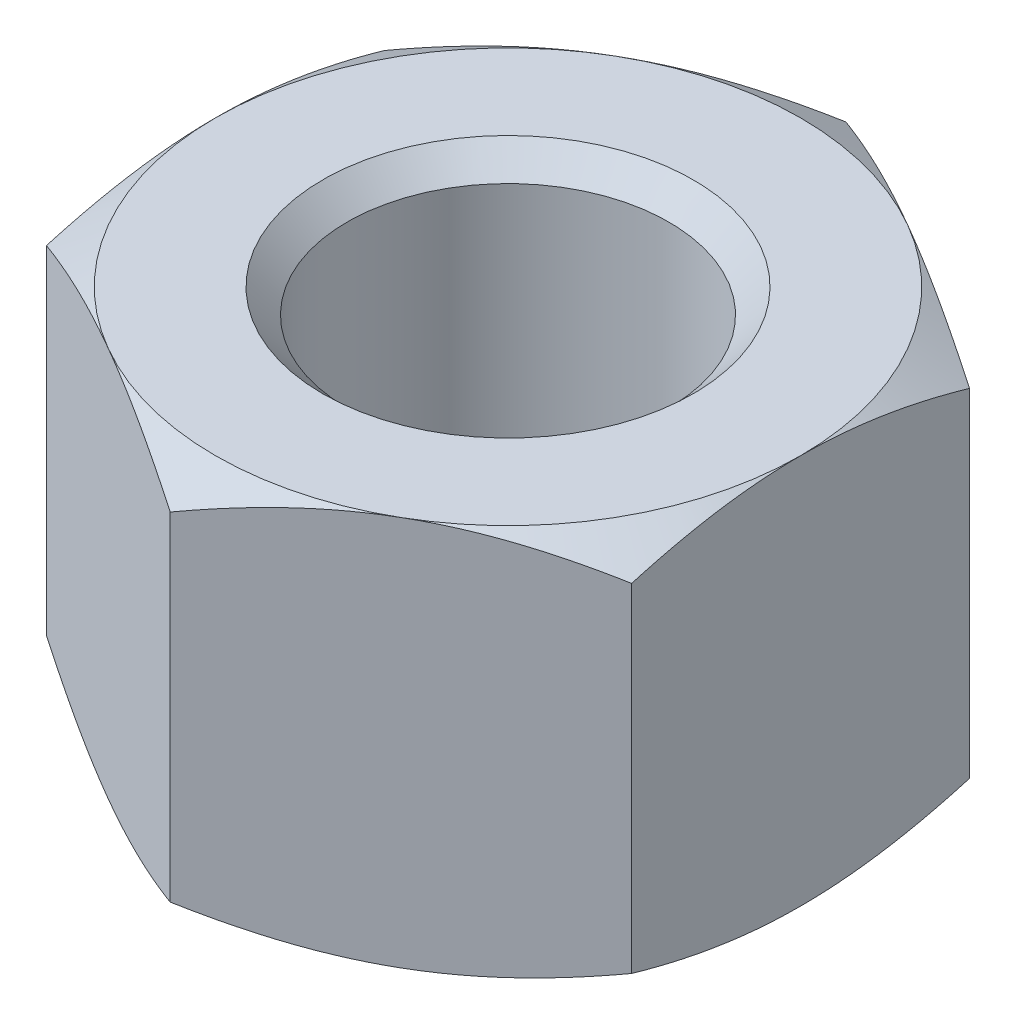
ISO-10303-21;
HEADER;
FILE_DESCRIPTION(('STEP AP214'),'2;1');
FILE_NAME('part.step','',(''),(''),'','','');
FILE_SCHEMA(('AUTOMOTIVE_DESIGN { 1 0 10303 214 1 1 1 1 }'));
ENDSEC;
DATA;
#1=APPLICATION_CONTEXT('core data for automotive mechanical design processes');
#2=APPLICATION_PROTOCOL_DEFINITION('international standard','automotive_design',2000,#1);
#3=PRODUCT_CONTEXT('',#1,'mechanical');
#4=PRODUCT('Part','Part','',(#3));
#5=PRODUCT_RELATED_PRODUCT_CATEGORY('part','',(#4));
#6=PRODUCT_DEFINITION_FORMATION('','',#4);
#7=PRODUCT_DEFINITION_CONTEXT('part definition',#1,'design');
#8=PRODUCT_DEFINITION('design','',#6,#7);
#9=PRODUCT_DEFINITION_SHAPE('','',#8);
#10=(LENGTH_UNIT() NAMED_UNIT(*) SI_UNIT(.MILLI.,.METRE.));
#11=(NAMED_UNIT(*) PLANE_ANGLE_UNIT() SI_UNIT($,.RADIAN.));
#12=(NAMED_UNIT(*) SI_UNIT($,.STERADIAN.) SOLID_ANGLE_UNIT());
#13=UNCERTAINTY_MEASURE_WITH_UNIT(LENGTH_MEASURE(1.E-05),#10,'distance_accuracy_value','');
#14=(GEOMETRIC_REPRESENTATION_CONTEXT(3) GLOBAL_UNCERTAINTY_ASSIGNED_CONTEXT((#13)) GLOBAL_UNIT_ASSIGNED_CONTEXT((#10,
#11,#12)) REPRESENTATION_CONTEXT('',''));
#15=CARTESIAN_POINT('',(0.,0.,0.));
#16=DIRECTION('',(0.,0.,1.));
#17=DIRECTION('',(1.,0.,0.));
#18=AXIS2_PLACEMENT_3D('',#15,#16,#17);
#19=CARTESIAN_POINT('',(0.,-2.,0.));
#20=DIRECTION('',(0.,1.,0.));
#21=DIRECTION('',(0.,0.,1.));
#22=AXIS2_PLACEMENT_3D('',#19,#20,#21);
#23=PLANE('',#22);
#24=CARTESIAN_POINT('',(0.,-2.,0.));
#25=DIRECTION('',(0.,1.,0.));
#26=DIRECTION('',(0.,0.,1.));
#27=AXIS2_PLACEMENT_3D('',#24,#25,#26);
#28=CIRCLE('',#27,1.9);
#29=CARTESIAN_POINT('',(0.,-2.,1.9));
#30=VERTEX_POINT('',#29);
#31=EDGE_CURVE('E12',#30,#30,#28,.T.);
#32=ORIENTED_EDGE('',*,*,#31,.T.);
#33=EDGE_LOOP('',(#32));
#34=FACE_BOUND('',#33,.T.);
#35=CARTESIAN_POINT('',(0.,-2.,0.));
#36=DIRECTION('',(0.,1.,0.));
#37=DIRECTION('',(0.,0.,1.));
#38=AXIS2_PLACEMENT_3D('',#35,#36,#37);
#39=CIRCLE('',#38,3.);
#40=CARTESIAN_POINT('',(1.5,-2.,2.59807621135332));
#41=VERTEX_POINT('',#40);
#42=CARTESIAN_POINT('',(-1.5,-2.,2.59807621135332));
#43=VERTEX_POINT('',#42);
#44=EDGE_CURVE('E140',#41,#43,#39,.F.);
#45=ORIENTED_EDGE('',*,*,#44,.T.);
#46=CARTESIAN_POINT('',(-3.,-2.,0.));
#47=VERTEX_POINT('',#46);
#48=EDGE_CURVE('E53',#43,#47,#39,.F.);
#49=ORIENTED_EDGE('',*,*,#48,.T.);
#50=CARTESIAN_POINT('',(-1.5,-2.,-2.59807621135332));
#51=VERTEX_POINT('',#50);
#52=EDGE_CURVE('E379',#47,#51,#39,.F.);
#53=ORIENTED_EDGE('',*,*,#52,.T.);
#54=CARTESIAN_POINT('',(1.5,-2.,-2.59807621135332));
#55=VERTEX_POINT('',#54);
#56=EDGE_CURVE('E381',#51,#55,#39,.F.);
#57=ORIENTED_EDGE('',*,*,#56,.T.);
#58=CARTESIAN_POINT('',(3.,-2.,0.));
#59=VERTEX_POINT('',#58);
#60=EDGE_CURVE('E145',#55,#59,#39,.F.);
#61=ORIENTED_EDGE('',*,*,#60,.T.);
#62=CARTESIAN_POINT('',(0.,-2.,0.));
#63=DIRECTION('',(0.,1.,0.));
#64=DIRECTION('',(0.,0.,1.));
#65=AXIS2_PLACEMENT_3D('',#62,#63,#64);
#66=CIRCLE('',#65,3.);
#67=EDGE_CURVE('E131',#41,#59,#66,.T.);
#68=ORIENTED_EDGE('',*,*,#67,.F.);
#69=EDGE_LOOP('',(#45,#49,#53,#57,#61,#68));
#70=FACE_BOUND('',#69,.T.);
#71=ADVANCED_FACE('F38',(#34,#70),#23,.F.);
#72=CARTESIAN_POINT('',(0.,2.,3.46410161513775));
#73=DIRECTION('',(-0.5,0.,-0.866025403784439));
#74=DIRECTION('',(-0.866025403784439,0.,0.5));
#75=AXIS2_PLACEMENT_3D('',#72,#73,#74);
#76=PLANE('',#75);
#77=DIRECTION('',(0.,-1.,0.));
#78=VECTOR('',#77,1.);
#79=CARTESIAN_POINT('',(0.,2.,3.46410161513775));
#80=LINE('',#79,#78);
#81=CARTESIAN_POINT('',(0.,1.73205080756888,3.46410161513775));
#82=VERTEX_POINT('',#81);
#83=CARTESIAN_POINT('',(0.,-1.73205080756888,3.46410161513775));
#84=VERTEX_POINT('',#83);
#85=EDGE_CURVE('E155',#82,#84,#80,.T.);
#86=ORIENTED_EDGE('',*,*,#85,.T.);
#87=CARTESIAN_POINT('',(-0.000200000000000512,-1.73198413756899,3.46421708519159));
#88=CARTESIAN_POINT('',(0.131635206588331,-1.77594629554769,3.38810199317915));
#89=CARTESIAN_POINT('',(0.264608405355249,-1.81592841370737,3.31132988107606));
#90=CARTESIAN_POINT('',(0.532857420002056,-1.88571791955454,3.15645624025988));
#91=CARTESIAN_POINT('',(0.668138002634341,-1.91550061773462,3.078351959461));
#92=CARTESIAN_POINT('',(0.937022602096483,-1.96186216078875,2.92311136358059));
#93=CARTESIAN_POINT('',(1.07058524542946,-1.97874955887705,2.84599893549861));
#94=CARTESIAN_POINT('',(1.33833905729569,-1.99891035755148,2.6914112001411));
#95=CARTESIAN_POINT('',(1.47252925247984,-2.00220045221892,2.61393645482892));
#96=CARTESIAN_POINT('',(1.72327559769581,-1.99535946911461,2.46916798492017));
#97=CARTESIAN_POINT('',(1.83986926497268,-1.98690808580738,2.40185259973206));
#98=CARTESIAN_POINT('',(2.07229698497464,-1.96012105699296,2.2676603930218));
#99=CARTESIAN_POINT('',(2.18813023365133,-1.94177625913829,2.2007840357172));
#100=CARTESIAN_POINT('',(2.42103725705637,-1.89591524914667,2.06631510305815));
#101=CARTESIAN_POINT('',(2.53808155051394,-1.86820461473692,1.99873954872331));
#102=CARTESIAN_POINT('',(2.77042435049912,-1.8053122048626,1.86459637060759));
#103=CARTESIAN_POINT('',(2.88572583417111,-1.77014520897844,1.79802702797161));
#104=CARTESIAN_POINT('',(3.0002,-1.73198413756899,1.73193533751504));
#105=B_SPLINE_CURVE_WITH_KNOTS('',3,(#87,#88,#89,#90,#91,#92,#93,#94,#95,#96,#97,#98,#99,#100,
#101,#102,#103,#104),.UNSPECIFIED.,.F.,.F.,(4,2,2,2,2,2,2,2,4),(0.,0.475539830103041,
0.952222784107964,1.41710776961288,1.88142182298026,2.28572436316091,2.69040156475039,
3.10405572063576,3.5168974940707),.UNSPECIFIED.);
#106=EDGE_CURVE('E60',#84,#41,#105,.T.);
#107=ORIENTED_EDGE('',*,*,#106,.T.);
#108=CARTESIAN_POINT('',(3.,-1.73205080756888,1.73205080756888));
#109=VERTEX_POINT('',#108);
#110=EDGE_CURVE('E128',#41,#109,#105,.T.);
#111=ORIENTED_EDGE('',*,*,#110,.T.);
#112=DIRECTION('',(0.,-1.,0.));
#113=VECTOR('',#112,1.);
#114=CARTESIAN_POINT('',(3.,2.,1.73205080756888));
#115=LINE('',#114,#113);
#116=CARTESIAN_POINT('',(3.,1.73205080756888,1.73205080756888));
#117=VERTEX_POINT('',#116);
#118=EDGE_CURVE('E272',#117,#109,#115,.T.);
#119=ORIENTED_EDGE('',*,*,#118,.F.);
#120=CARTESIAN_POINT('',(-0.000200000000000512,1.73198413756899,3.46421708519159));
#121=CARTESIAN_POINT('',(0.131635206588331,1.77594629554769,3.38810199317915));
#122=CARTESIAN_POINT('',(0.264608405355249,1.81592841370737,3.31132988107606));
#123=CARTESIAN_POINT('',(0.532857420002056,1.88571791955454,3.15645624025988));
#124=CARTESIAN_POINT('',(0.668138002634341,1.91550061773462,3.078351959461));
#125=CARTESIAN_POINT('',(0.937022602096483,1.96186216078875,2.92311136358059));
#126=CARTESIAN_POINT('',(1.07058524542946,1.97874955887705,2.84599893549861));
#127=CARTESIAN_POINT('',(1.33833905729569,1.99891035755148,2.6914112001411));
#128=CARTESIAN_POINT('',(1.47252925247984,2.00220045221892,2.61393645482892));
#129=CARTESIAN_POINT('',(1.72327559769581,1.99535946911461,2.46916798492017));
#130=CARTESIAN_POINT('',(1.83986926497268,1.98690808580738,2.40185259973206));
#131=CARTESIAN_POINT('',(2.07229698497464,1.96012105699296,2.2676603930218));
#132=CARTESIAN_POINT('',(2.18813023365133,1.94177625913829,2.2007840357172));
#133=CARTESIAN_POINT('',(2.42103725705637,1.89591524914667,2.06631510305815));
#134=CARTESIAN_POINT('',(2.53808155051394,1.86820461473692,1.99873954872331));
#135=CARTESIAN_POINT('',(2.77042435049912,1.8053122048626,1.86459637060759));
#136=CARTESIAN_POINT('',(2.88572583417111,1.77014520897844,1.79802702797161));
#137=CARTESIAN_POINT('',(3.0002,1.73198413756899,1.73193533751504));
#138=B_SPLINE_CURVE_WITH_KNOTS('',3,(#120,#121,#122,#123,#124,#125,#126,#127,#128,#129,#130,
#131,#132,#133,#134,#135,#136,#137),.UNSPECIFIED.,.F.,.F.,(4,2,2,2,2,2,2,2,4),(0.,
0.475539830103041,0.952222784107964,1.41710776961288,1.88142182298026,2.28572436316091,
2.69040156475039,3.10405572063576,3.5168974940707),.UNSPECIFIED.);
#139=CARTESIAN_POINT('',(1.5,2.,2.59807621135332));
#140=VERTEX_POINT('',#139);
#141=EDGE_CURVE('E252',#140,#117,#138,.T.);
#142=ORIENTED_EDGE('',*,*,#141,.F.);
#143=EDGE_CURVE('E258',#82,#140,#138,.T.);
#144=ORIENTED_EDGE('',*,*,#143,.F.);
#145=EDGE_LOOP('',(#86,#107,#111,#119,#142,#144));
#146=FACE_BOUND('',#145,.T.);
#147=ADVANCED_FACE('F152',(#146),#76,.F.);
#148=CARTESIAN_POINT('',(3.,2.,1.73205080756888));
#149=DIRECTION('',(-1.,0.,0.));
#150=DIRECTION('',(0.,0.,1.));
#151=AXIS2_PLACEMENT_3D('',#148,#149,#150);
#152=PLANE('',#151);
#153=ORIENTED_EDGE('',*,*,#118,.T.);
#154=CARTESIAN_POINT('',(3.,-0.501054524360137,-4.72419421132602));
#155=CARTESIAN_POINT('',(3.,-0.565208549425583,-4.59252982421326));
#156=CARTESIAN_POINT('',(3.,-0.628767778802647,-4.46057075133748));
#157=CARTESIAN_POINT('',(3.,-0.75436344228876,-4.19590675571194));
#158=CARTESIAN_POINT('',(3.,-0.816399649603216,-4.06320172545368));
#159=CARTESIAN_POINT('',(3.,-0.938912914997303,-3.79623955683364));
#160=CARTESIAN_POINT('',(3.,-0.999380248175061,-3.66197794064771));
#161=CARTESIAN_POINT('',(3.,-1.11793387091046,-3.39241144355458));
#162=CARTESIAN_POINT('',(3.,-1.17602026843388,-3.25710661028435));
#163=CARTESIAN_POINT('',(3.,-1.29110063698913,-2.98063811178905));
#164=CARTESIAN_POINT('',(3.,-1.34799110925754,-2.83943113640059));
#165=CARTESIAN_POINT('',(3.,-1.45763737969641,-2.55539190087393));
#166=CARTESIAN_POINT('',(3.,-1.51039272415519,-2.41255946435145));
#167=CARTESIAN_POINT('',(3.,-1.61043634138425,-2.12528687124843));
#168=CARTESIAN_POINT('',(3.,-1.65773508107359,-1.98085039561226));
#169=CARTESIAN_POINT('',(3.,-1.74539546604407,-1.68990675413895));
#170=CARTESIAN_POINT('',(3.,-1.78575922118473,-1.54340023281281));
#171=CARTESIAN_POINT('',(3.,-1.8574462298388,-1.2490437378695));
#172=CARTESIAN_POINT('',(3.,-1.88882005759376,-1.10120630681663));
#173=CARTESIAN_POINT('',(3.,-1.94080019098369,-0.803620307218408));
#174=CARTESIAN_POINT('',(3.,-1.96140766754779,-0.653871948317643));
#175=CARTESIAN_POINT('',(3.,-1.98994502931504,-0.355196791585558));
#176=CARTESIAN_POINT('',(3.,-1.99804348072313,-0.206286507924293));
#177=CARTESIAN_POINT('',(3.,-2.0013247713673,0.0916923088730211));
#178=CARTESIAN_POINT('',(3.,-1.9965074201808,0.240760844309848));
#179=CARTESIAN_POINT('',(3.,-1.97787199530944,0.491723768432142));
#180=CARTESIAN_POINT('',(3.,-1.96731758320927,0.593876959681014));
#181=CARTESIAN_POINT('',(3.,-1.94076249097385,0.797477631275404));
#182=CARTESIAN_POINT('',(3.,-1.92476113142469,0.898925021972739));
#183=CARTESIAN_POINT('',(3.,-1.86942337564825,1.20204703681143));
#184=CARTESIAN_POINT('',(3.,-1.82276174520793,1.40240158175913));
#185=CARTESIAN_POINT('',(3.,-1.74129864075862,1.70214891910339));
#186=CARTESIAN_POINT('',(3.,-1.71182816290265,1.80307937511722));
#187=CARTESIAN_POINT('',(3.,-1.64969066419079,2.00396102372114));
#188=CARTESIAN_POINT('',(3.,-1.61702361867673,2.10391220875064));
#189=CARTESIAN_POINT('',(3.,-1.54902842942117,2.30286555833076));
#190=CARTESIAN_POINT('',(3.,-1.51370103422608,2.40186798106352));
#191=CARTESIAN_POINT('',(3.,-1.44081429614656,2.59904247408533));
#192=CARTESIAN_POINT('',(3.,-1.40325500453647,2.69721456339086));
#193=CARTESIAN_POINT('',(3.,-1.29921162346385,2.96159002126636));
#194=CARTESIAN_POINT('',(3.,-1.23095748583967,3.12709614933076));
#195=CARTESIAN_POINT('',(3.,-1.09043300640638,3.45640087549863));
#196=CARTESIAN_POINT('',(3.,-1.01816221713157,3.62019928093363));
#197=CARTESIAN_POINT('',(3.,-0.870559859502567,3.94647574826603));
#198=CARTESIAN_POINT('',(3.,-0.795227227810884,4.10895332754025));
#199=CARTESIAN_POINT('',(3.,-0.642221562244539,4.43280485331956));
#200=CARTESIAN_POINT('',(3.,-0.564548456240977,4.59417876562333));
#201=CARTESIAN_POINT('',(3.,-0.328572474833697,5.07748126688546));
#202=CARTESIAN_POINT('',(3.,-0.167548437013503,5.39807947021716));
#203=CARTESIAN_POINT('',(3.,0.159040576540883,6.03685099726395));
#204=CARTESIAN_POINT('',(3.,0.324604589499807,6.35502481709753));
#205=CARTESIAN_POINT('',(3.,0.641121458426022,6.95610524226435));
#206=CARTESIAN_POINT('',(3.,0.791763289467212,7.23917590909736));
#207=CARTESIAN_POINT('',(3.,1.09485975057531,7.80436605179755));
#208=CARTESIAN_POINT('',(3.,1.24731449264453,8.08648546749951));
#209=CARTESIAN_POINT('',(3.,1.55305256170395,8.6490441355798));
#210=CARTESIAN_POINT('',(3.,1.70633136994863,8.92948584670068));
#211=CARTESIAN_POINT('',(3.,2.01391884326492,9.4897751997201));
#212=CARTESIAN_POINT('',(3.,2.16822742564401,9.76962288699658));
#213=CARTESIAN_POINT('',(3.,2.32291043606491,10.0492620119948));
#214=B_SPLINE_CURVE_WITH_KNOTS('',3,(#154,#155,#156,#157,#158,#159,#160,#161,#162,#163,#164,
#165,#166,#167,#168,#169,#170,#171,#172,#173,#174,#175,#176,#177,#178,#179,#180,#181,#182,#183,
#184,#185,#186,#187,#188,#189,#190,#191,#192,#193,#194,#195,#196,#197,#198,#199,#200,#201,#202,
#203,#204,#205,#206,#207,#208,#209,#210,#211,#212,#213),.UNSPECIFIED.,.F.,.F.,(4,2,2,2,2,2,2,2,
2,2,2,2,2,2,2,2,2,2,2,2,2,2,2,2,2,2,2,2,2,4),(0.,0.439392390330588,0.878849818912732,
1.32058042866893,1.76229098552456,2.21895022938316,2.67565950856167,3.13147762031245,
3.58715681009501,4.04021978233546,4.49323346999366,4.94008757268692,5.38694826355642,
5.69489123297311,6.00287262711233,6.61913487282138,6.934541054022,7.24994966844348,
7.56526986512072,7.88058282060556,8.41758645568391,8.95465003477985,9.49190174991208,
10.0291700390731,11.1053945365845,12.1813925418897,13.1433594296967,14.1053860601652,
15.0641732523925,16.0228843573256),.UNSPECIFIED.);
#215=EDGE_CURVE('E134',#109,#59,#214,.F.);
#216=ORIENTED_EDGE('',*,*,#215,.T.);
#217=CARTESIAN_POINT('',(3.,-1.73205080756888,-1.73205080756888));
#218=VERTEX_POINT('',#217);
#219=EDGE_CURVE('E167',#59,#218,#214,.F.);
#220=ORIENTED_EDGE('',*,*,#219,.T.);
#221=DIRECTION('',(0.,-1.,0.));
#222=VECTOR('',#221,1.);
#223=CARTESIAN_POINT('',(3.,2.,-1.73205080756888));
#224=LINE('',#223,#222);
#225=CARTESIAN_POINT('',(3.,1.73205080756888,-1.73205080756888));
#226=VERTEX_POINT('',#225);
#227=EDGE_CURVE('E269',#226,#218,#224,.T.);
#228=ORIENTED_EDGE('',*,*,#227,.F.);
#229=CARTESIAN_POINT('',(3.,0.501054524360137,-4.72419421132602));
#230=CARTESIAN_POINT('',(3.,0.565208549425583,-4.59252982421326));
#231=CARTESIAN_POINT('',(3.,0.628767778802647,-4.46057075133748));
#232=CARTESIAN_POINT('',(3.,0.75436344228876,-4.19590675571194));
#233=CARTESIAN_POINT('',(3.,0.816399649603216,-4.06320172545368));
#234=CARTESIAN_POINT('',(3.,0.938912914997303,-3.79623955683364));
#235=CARTESIAN_POINT('',(3.,0.999380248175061,-3.66197794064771));
#236=CARTESIAN_POINT('',(3.,1.11793387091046,-3.39241144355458));
#237=CARTESIAN_POINT('',(3.,1.17602026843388,-3.25710661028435));
#238=CARTESIAN_POINT('',(3.,1.29110063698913,-2.98063811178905));
#239=CARTESIAN_POINT('',(3.,1.34799110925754,-2.83943113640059));
#240=CARTESIAN_POINT('',(3.,1.45763737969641,-2.55539190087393));
#241=CARTESIAN_POINT('',(3.,1.51039272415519,-2.41255946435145));
#242=CARTESIAN_POINT('',(3.,1.61043634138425,-2.12528687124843));
#243=CARTESIAN_POINT('',(3.,1.65773508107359,-1.98085039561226));
#244=CARTESIAN_POINT('',(3.,1.74539546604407,-1.68990675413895));
#245=CARTESIAN_POINT('',(3.,1.78575922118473,-1.54340023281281));
#246=CARTESIAN_POINT('',(3.,1.8574462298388,-1.2490437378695));
#247=CARTESIAN_POINT('',(3.,1.88882005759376,-1.10120630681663));
#248=CARTESIAN_POINT('',(3.,1.94080019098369,-0.803620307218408));
#249=CARTESIAN_POINT('',(3.,1.96140766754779,-0.653871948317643));
#250=CARTESIAN_POINT('',(3.,1.98994502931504,-0.355196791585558));
#251=CARTESIAN_POINT('',(3.,1.99804348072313,-0.206286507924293));
#252=CARTESIAN_POINT('',(3.,2.0013247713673,0.0916923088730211));
#253=CARTESIAN_POINT('',(3.,1.9965074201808,0.240760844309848));
#254=CARTESIAN_POINT('',(3.,1.97787199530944,0.491723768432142));
#255=CARTESIAN_POINT('',(3.,1.96731758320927,0.593876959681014));
#256=CARTESIAN_POINT('',(3.,1.94076249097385,0.797477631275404));
#257=CARTESIAN_POINT('',(3.,1.92476113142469,0.898925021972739));
#258=CARTESIAN_POINT('',(3.,1.86942337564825,1.20204703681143));
#259=CARTESIAN_POINT('',(3.,1.82276174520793,1.40240158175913));
#260=CARTESIAN_POINT('',(3.,1.74129864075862,1.70214891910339));
#261=CARTESIAN_POINT('',(3.,1.71182816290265,1.80307937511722));
#262=CARTESIAN_POINT('',(3.,1.64969066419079,2.00396102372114));
#263=CARTESIAN_POINT('',(3.,1.61702361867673,2.10391220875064));
#264=CARTESIAN_POINT('',(3.,1.54902842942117,2.30286555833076));
#265=CARTESIAN_POINT('',(3.,1.51370103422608,2.40186798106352));
#266=CARTESIAN_POINT('',(3.,1.44081429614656,2.59904247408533));
#267=CARTESIAN_POINT('',(3.,1.40325500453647,2.69721456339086));
#268=CARTESIAN_POINT('',(3.,1.29921162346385,2.96159002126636));
#269=CARTESIAN_POINT('',(3.,1.23095748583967,3.12709614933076));
#270=CARTESIAN_POINT('',(3.,1.09043300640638,3.45640087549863));
#271=CARTESIAN_POINT('',(3.,1.01816221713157,3.62019928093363));
#272=CARTESIAN_POINT('',(3.,0.870559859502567,3.94647574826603));
#273=CARTESIAN_POINT('',(3.,0.795227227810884,4.10895332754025));
#274=CARTESIAN_POINT('',(3.,0.642221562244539,4.43280485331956));
#275=CARTESIAN_POINT('',(3.,0.564548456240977,4.59417876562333));
#276=CARTESIAN_POINT('',(3.,0.328572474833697,5.07748126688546));
#277=CARTESIAN_POINT('',(3.,0.167548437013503,5.39807947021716));
#278=CARTESIAN_POINT('',(3.,-0.159040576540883,6.03685099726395));
#279=CARTESIAN_POINT('',(3.,-0.324604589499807,6.35502481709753));
#280=CARTESIAN_POINT('',(3.,-0.641121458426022,6.95610524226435));
#281=CARTESIAN_POINT('',(3.,-0.791763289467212,7.23917590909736));
#282=CARTESIAN_POINT('',(3.,-1.09485975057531,7.80436605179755));
#283=CARTESIAN_POINT('',(3.,-1.24731449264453,8.08648546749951));
#284=CARTESIAN_POINT('',(3.,-1.55305256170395,8.6490441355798));
#285=CARTESIAN_POINT('',(3.,-1.70633136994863,8.92948584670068));
#286=CARTESIAN_POINT('',(3.,-2.01391884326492,9.4897751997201));
#287=CARTESIAN_POINT('',(3.,-2.16822742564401,9.76962288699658));
#288=CARTESIAN_POINT('',(3.,-2.32291043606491,10.0492620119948));
#289=B_SPLINE_CURVE_WITH_KNOTS('',3,(#229,#230,#231,#232,#233,#234,#235,#236,#237,#238,#239,
#240,#241,#242,#243,#244,#245,#246,#247,#248,#249,#250,#251,#252,#253,#254,#255,#256,#257,#258,
#259,#260,#261,#262,#263,#264,#265,#266,#267,#268,#269,#270,#271,#272,#273,#274,#275,#276,#277,
#278,#279,#280,#281,#282,#283,#284,#285,#286,#287,#288),.UNSPECIFIED.,.F.,.F.,(4,2,2,2,2,2,2,2,
2,2,2,2,2,2,2,2,2,2,2,2,2,2,2,2,2,2,2,2,2,4),(0.,0.439392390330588,0.878849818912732,
1.32058042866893,1.76229098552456,2.21895022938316,2.67565950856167,3.13147762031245,
3.58715681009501,4.04021978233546,4.49323346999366,4.94008757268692,5.38694826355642,
5.69489123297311,6.00287262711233,6.61913487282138,6.934541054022,7.24994966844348,
7.56526986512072,7.88058282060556,8.41758645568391,8.95465003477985,9.49190174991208,
10.0291700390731,11.1053945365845,12.1813925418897,13.1433594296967,14.1053860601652,
15.0641732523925,16.0228843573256),.UNSPECIFIED.);
#290=CARTESIAN_POINT('',(3.,2.,0.));
#291=VERTEX_POINT('',#290);
#292=EDGE_CURVE('E245',#291,#226,#289,.F.);
#293=ORIENTED_EDGE('',*,*,#292,.F.);
#294=EDGE_CURVE('E251',#117,#291,#289,.F.);
#295=ORIENTED_EDGE('',*,*,#294,.F.);
#296=EDGE_LOOP('',(#153,#216,#220,#228,#293,#295));
#297=FACE_BOUND('',#296,.T.);
#298=ADVANCED_FACE('F224',(#297),#152,.F.);
#299=CARTESIAN_POINT('',(3.,2.,-1.73205080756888));
#300=DIRECTION('',(-0.5,0.,0.866025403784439));
#301=DIRECTION('',(0.866025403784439,0.,0.5));
#302=AXIS2_PLACEMENT_3D('',#299,#300,#301);
#303=PLANE('',#302);
#304=ORIENTED_EDGE('',*,*,#227,.T.);
#305=CARTESIAN_POINT('',(3.0002,-1.73198413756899,-1.73193533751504));
#306=CARTESIAN_POINT('',(2.86836479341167,-1.77594629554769,-1.80805042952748));
#307=CARTESIAN_POINT('',(2.73539159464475,-1.81592841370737,-1.88482254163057));
#308=CARTESIAN_POINT('',(2.46714257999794,-1.88571791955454,-2.03969618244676));
#309=CARTESIAN_POINT('',(2.33186199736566,-1.91550061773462,-2.11780046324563));
#310=CARTESIAN_POINT('',(2.06297739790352,-1.96186216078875,-2.27304105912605));
#311=CARTESIAN_POINT('',(1.92941475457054,-1.97874955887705,-2.35015348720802));
#312=CARTESIAN_POINT('',(1.66166094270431,-1.99891035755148,-2.50474122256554));
#313=CARTESIAN_POINT('',(1.52747074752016,-2.00220045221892,-2.58221596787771));
#314=CARTESIAN_POINT('',(1.27672440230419,-1.99535946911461,-2.72698443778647));
#315=CARTESIAN_POINT('',(1.16013073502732,-1.98690808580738,-2.79429982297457));
#316=CARTESIAN_POINT('',(0.927703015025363,-1.96012105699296,-2.92849202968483));
#317=CARTESIAN_POINT('',(0.811869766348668,-1.94177625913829,-2.99536838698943));
#318=CARTESIAN_POINT('',(0.578962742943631,-1.89591524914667,-3.12983731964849));
#319=CARTESIAN_POINT('',(0.461918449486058,-1.86820461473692,-3.19741287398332));
#320=CARTESIAN_POINT('',(0.229575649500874,-1.8053122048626,-3.33155605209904));
#321=CARTESIAN_POINT('',(0.114274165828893,-1.77014520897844,-3.39812539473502));
#322=CARTESIAN_POINT('',(-0.000200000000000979,-1.73198413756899,-3.46421708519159));
#323=B_SPLINE_CURVE_WITH_KNOTS('',3,(#305,#306,#307,#308,#309,#310,#311,#312,#313,#314,#315,
#316,#317,#318,#319,#320,#321,#322),.UNSPECIFIED.,.F.,.F.,(4,2,2,2,2,2,2,2,4),(0.,
0.475539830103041,0.952222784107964,1.41710776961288,1.88142182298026,2.28572436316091,
2.69040156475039,3.10405572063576,3.5168974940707),.UNSPECIFIED.);
#324=EDGE_CURVE('E218',#218,#55,#323,.T.);
#325=ORIENTED_EDGE('',*,*,#324,.T.);
#326=CARTESIAN_POINT('',(0.,-1.73205080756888,-3.46410161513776));
#327=VERTEX_POINT('',#326);
#328=EDGE_CURVE('E211',#55,#327,#323,.T.);
#329=ORIENTED_EDGE('',*,*,#328,.T.);
#330=DIRECTION('',(0.,-1.,0.));
#331=VECTOR('',#330,1.);
#332=CARTESIAN_POINT('',(0.,2.,-3.46410161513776));
#333=LINE('',#332,#331);
#334=CARTESIAN_POINT('',(0.,1.73205080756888,-3.46410161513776));
#335=VERTEX_POINT('',#334);
#336=EDGE_CURVE('E266',#335,#327,#333,.T.);
#337=ORIENTED_EDGE('',*,*,#336,.F.);
#338=CARTESIAN_POINT('',(3.0002,1.73198413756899,-1.73193533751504));
#339=CARTESIAN_POINT('',(2.86836479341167,1.77594629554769,-1.80805042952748));
#340=CARTESIAN_POINT('',(2.73539159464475,1.81592841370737,-1.88482254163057));
#341=CARTESIAN_POINT('',(2.46714257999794,1.88571791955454,-2.03969618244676));
#342=CARTESIAN_POINT('',(2.33186199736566,1.91550061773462,-2.11780046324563));
#343=CARTESIAN_POINT('',(2.06297739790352,1.96186216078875,-2.27304105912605));
#344=CARTESIAN_POINT('',(1.92941475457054,1.97874955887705,-2.35015348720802));
#345=CARTESIAN_POINT('',(1.66166094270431,1.99891035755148,-2.50474122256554));
#346=CARTESIAN_POINT('',(1.52747074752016,2.00220045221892,-2.58221596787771));
#347=CARTESIAN_POINT('',(1.27672440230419,1.99535946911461,-2.72698443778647));
#348=CARTESIAN_POINT('',(1.16013073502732,1.98690808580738,-2.79429982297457));
#349=CARTESIAN_POINT('',(0.927703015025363,1.96012105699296,-2.92849202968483));
#350=CARTESIAN_POINT('',(0.811869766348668,1.94177625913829,-2.99536838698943));
#351=CARTESIAN_POINT('',(0.578962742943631,1.89591524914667,-3.12983731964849));
#352=CARTESIAN_POINT('',(0.461918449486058,1.86820461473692,-3.19741287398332));
#353=CARTESIAN_POINT('',(0.229575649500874,1.8053122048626,-3.33155605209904));
#354=CARTESIAN_POINT('',(0.114274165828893,1.77014520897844,-3.39812539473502));
#355=CARTESIAN_POINT('',(-0.000200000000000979,1.73198413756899,-3.46421708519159));
#356=B_SPLINE_CURVE_WITH_KNOTS('',3,(#338,#339,#340,#341,#342,#343,#344,#345,#346,#347,#348,
#349,#350,#351,#352,#353,#354,#355),.UNSPECIFIED.,.F.,.F.,(4,2,2,2,2,2,2,2,4),(0.,
0.475539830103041,0.952222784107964,1.41710776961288,1.88142182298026,2.28572436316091,
2.69040156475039,3.10405572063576,3.5168974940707),.UNSPECIFIED.);
#357=CARTESIAN_POINT('',(1.5,2.,-2.59807621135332));
#358=VERTEX_POINT('',#357);
#359=EDGE_CURVE('E230',#358,#335,#356,.T.);
#360=ORIENTED_EDGE('',*,*,#359,.F.);
#361=EDGE_CURVE('E237',#226,#358,#356,.T.);
#362=ORIENTED_EDGE('',*,*,#361,.F.);
#363=EDGE_LOOP('',(#304,#325,#329,#337,#360,#362));
#364=FACE_BOUND('',#363,.T.);
#365=ADVANCED_FACE('F220',(#364),#303,.F.);
#366=CARTESIAN_POINT('',(0.,2.,-3.46410161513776));
#367=DIRECTION('',(0.5,0.,0.866025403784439));
#368=DIRECTION('',(0.866025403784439,0.,-0.5));
#369=AXIS2_PLACEMENT_3D('',#366,#367,#368);
#370=PLANE('',#369);
#371=ORIENTED_EDGE('',*,*,#336,.T.);
#372=CARTESIAN_POINT('',(0.000199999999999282,-1.73198413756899,-3.46421708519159));
#373=CARTESIAN_POINT('',(-0.131635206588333,-1.77594629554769,-3.38810199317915));
#374=CARTESIAN_POINT('',(-0.26460840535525,-1.81592841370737,-3.31132988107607));
#375=CARTESIAN_POINT('',(-0.532857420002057,-1.88571791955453,-3.15645624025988));
#376=CARTESIAN_POINT('',(-0.668138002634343,-1.91550061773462,-3.078351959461));
#377=CARTESIAN_POINT('',(-0.937022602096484,-1.96186216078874,-2.92311136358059));
#378=CARTESIAN_POINT('',(-1.07058524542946,-1.97874955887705,-2.84599893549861));
#379=CARTESIAN_POINT('',(-1.33833905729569,-1.99891035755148,-2.6914112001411));
#380=CARTESIAN_POINT('',(-1.47252925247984,-2.00220045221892,-2.61393645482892));
#381=CARTESIAN_POINT('',(-1.72327559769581,-1.99535946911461,-2.46916798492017));
#382=CARTESIAN_POINT('',(-1.83986926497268,-1.98690808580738,-2.40185259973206));
#383=CARTESIAN_POINT('',(-2.07229698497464,-1.96012105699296,-2.2676603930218));
#384=CARTESIAN_POINT('',(-2.18813023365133,-1.94177625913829,-2.2007840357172));
#385=CARTESIAN_POINT('',(-2.42103725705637,-1.89591524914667,-2.06631510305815));
#386=CARTESIAN_POINT('',(-2.53808155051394,-1.86820461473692,-1.99873954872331));
#387=CARTESIAN_POINT('',(-2.77042435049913,-1.8053122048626,-1.86459637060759));
#388=CARTESIAN_POINT('',(-2.88572583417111,-1.77014520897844,-1.79802702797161));
#389=CARTESIAN_POINT('',(-3.0002,-1.73198413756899,-1.73193533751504));
#390=B_SPLINE_CURVE_WITH_KNOTS('',3,(#372,#373,#374,#375,#376,#377,#378,#379,#380,#381,#382,
#383,#384,#385,#386,#387,#388,#389),.UNSPECIFIED.,.F.,.F.,(4,2,2,2,2,2,2,2,4),(0.,
0.475539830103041,0.952222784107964,1.41710776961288,1.88142182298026,2.28572436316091,
2.69040156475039,3.10405572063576,3.5168974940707),.UNSPECIFIED.);
#391=EDGE_CURVE('E219',#327,#51,#390,.T.);
#392=ORIENTED_EDGE('',*,*,#391,.T.);
#393=CARTESIAN_POINT('',(-3.,-1.73205080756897,-1.73205080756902));
#394=VERTEX_POINT('',#393);
#395=EDGE_CURVE('E205',#51,#394,#390,.T.);
#396=ORIENTED_EDGE('',*,*,#395,.T.);
#397=DIRECTION('',(0.,-1.,0.));
#398=VECTOR('',#397,1.);
#399=CARTESIAN_POINT('',(-3.,2.,-1.73205080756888));
#400=LINE('',#399,#398);
#401=CARTESIAN_POINT('',(-3.,1.73205080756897,-1.73205080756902));
#402=VERTEX_POINT('',#401);
#403=EDGE_CURVE('E263',#402,#394,#400,.T.);
#404=ORIENTED_EDGE('',*,*,#403,.F.);
#405=CARTESIAN_POINT('',(0.000199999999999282,1.73198413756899,-3.46421708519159));
#406=CARTESIAN_POINT('',(-0.131635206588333,1.77594629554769,-3.38810199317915));
#407=CARTESIAN_POINT('',(-0.26460840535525,1.81592841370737,-3.31132988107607));
#408=CARTESIAN_POINT('',(-0.532857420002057,1.88571791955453,-3.15645624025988));
#409=CARTESIAN_POINT('',(-0.668138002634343,1.91550061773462,-3.078351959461));
#410=CARTESIAN_POINT('',(-0.937022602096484,1.96186216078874,-2.92311136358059));
#411=CARTESIAN_POINT('',(-1.07058524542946,1.97874955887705,-2.84599893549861));
#412=CARTESIAN_POINT('',(-1.33833905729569,1.99891035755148,-2.6914112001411));
#413=CARTESIAN_POINT('',(-1.47252925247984,2.00220045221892,-2.61393645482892));
#414=CARTESIAN_POINT('',(-1.72327559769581,1.99535946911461,-2.46916798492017));
#415=CARTESIAN_POINT('',(-1.83986926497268,1.98690808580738,-2.40185259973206));
#416=CARTESIAN_POINT('',(-2.07229698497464,1.96012105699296,-2.2676603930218));
#417=CARTESIAN_POINT('',(-2.18813023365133,1.94177625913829,-2.2007840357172));
#418=CARTESIAN_POINT('',(-2.42103725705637,1.89591524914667,-2.06631510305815));
#419=CARTESIAN_POINT('',(-2.53808155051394,1.86820461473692,-1.99873954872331));
#420=CARTESIAN_POINT('',(-2.77042435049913,1.8053122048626,-1.86459637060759));
#421=CARTESIAN_POINT('',(-2.88572583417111,1.77014520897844,-1.79802702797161));
#422=CARTESIAN_POINT('',(-3.0002,1.73198413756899,-1.73193533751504));
#423=B_SPLINE_CURVE_WITH_KNOTS('',3,(#405,#406,#407,#408,#409,#410,#411,#412,#413,#414,#415,
#416,#417,#418,#419,#420,#421,#422),.UNSPECIFIED.,.F.,.F.,(4,2,2,2,2,2,2,2,4),(0.,
0.475539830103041,0.952222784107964,1.41710776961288,1.88142182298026,2.28572436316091,
2.69040156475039,3.10405572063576,3.5168974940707),.UNSPECIFIED.);
#424=CARTESIAN_POINT('',(-1.5,2.,-2.59807621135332));
#425=VERTEX_POINT('',#424);
#426=EDGE_CURVE('E239',#425,#402,#423,.T.);
#427=ORIENTED_EDGE('',*,*,#426,.F.);
#428=EDGE_CURVE('E238',#335,#425,#423,.T.);
#429=ORIENTED_EDGE('',*,*,#428,.F.);
#430=EDGE_LOOP('',(#371,#392,#396,#404,#427,#429));
#431=FACE_BOUND('',#430,.T.);
#432=ADVANCED_FACE('F223',(#431),#370,.F.);
#433=CARTESIAN_POINT('',(-3.,2.,-1.73205080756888));
#434=DIRECTION('',(1.,0.,0.));
#435=DIRECTION('',(0.,0.,-1.));
#436=AXIS2_PLACEMENT_3D('',#433,#434,#435);
#437=PLANE('',#436);
#438=ORIENTED_EDGE('',*,*,#403,.T.);
#439=CARTESIAN_POINT('',(-3.,-0.50105452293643,-4.72419421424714));
#440=CARTESIAN_POINT('',(-3.,-0.565208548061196,-4.59252982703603));
#441=CARTESIAN_POINT('',(-3.,-0.628767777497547,-4.46057075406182));
#442=CARTESIAN_POINT('',(-3.,-0.754363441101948,-4.19590675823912));
#443=CARTESIAN_POINT('',(-3.,-0.816399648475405,-4.06320172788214));
#444=CARTESIAN_POINT('',(-3.,-0.938912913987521,-3.79623955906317));
#445=CARTESIAN_POINT('',(-3.,-0.999380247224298,-3.66197794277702));
#446=CARTESIAN_POINT('',(-3.,-1.11793387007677,-3.39241144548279));
#447=CARTESIAN_POINT('',(-3.,-1.17602026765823,-3.25710661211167));
#448=CARTESIAN_POINT('',(-3.,-1.29110063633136,-2.9806381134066));
#449=CARTESIAN_POINT('',(-3.,-1.34799110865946,-2.83943113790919));
#450=CARTESIAN_POINT('',(-3.,-1.45763737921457,-2.55539190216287));
#451=CARTESIAN_POINT('',(-3.,-1.51039272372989,-2.4125594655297));
#452=CARTESIAN_POINT('',(-3.,-1.61043634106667,-2.12528687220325));
#453=CARTESIAN_POINT('',(-3.,-1.65773508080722,-1.98085039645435));
#454=CARTESIAN_POINT('',(-3.,-1.74539546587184,-1.68990675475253));
#455=CARTESIAN_POINT('',(-3.,-1.78575922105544,-1.54340023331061));
#456=CARTESIAN_POINT('',(-3.,-1.85744622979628,-1.2490437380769));
#457=CARTESIAN_POINT('',(-3.,-1.8888200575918,-1.10120630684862));
#458=CARTESIAN_POINT('',(-3.,-1.9408001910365,-0.803620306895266));
#459=CARTESIAN_POINT('',(-3.,-1.96140766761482,-0.653871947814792));
#460=CARTESIAN_POINT('',(-3.,-1.98994502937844,-0.355196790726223));
#461=CARTESIAN_POINT('',(-3.,-1.99804348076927,-0.206286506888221));
#462=CARTESIAN_POINT('',(-3.,-2.00132477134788,0.0916923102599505));
#463=CARTESIAN_POINT('',(-3.,-1.99650742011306,0.240760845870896));
#464=CARTESIAN_POINT('',(-3.,-1.97787199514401,0.491723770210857));
#465=CARTESIAN_POINT('',(-3.,-1.96731758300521,0.593876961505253));
#466=CARTESIAN_POINT('',(-3.,-1.94076249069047,0.797477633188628));
#467=CARTESIAN_POINT('',(-3.,-1.92476113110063,0.898925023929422));
#468=CARTESIAN_POINT('',(-3.,-1.86942337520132,1.20204703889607));
#469=CARTESIAN_POINT('',(-3.,-1.82276174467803,1.40240158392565));
#470=CARTESIAN_POINT('',(-3.,-1.74129864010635,1.70214892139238));
#471=CARTESIAN_POINT('',(-3.,-1.71182816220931,1.80307937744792));
#472=CARTESIAN_POINT('',(-3.,-1.6496906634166,2.00396102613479));
#473=CARTESIAN_POINT('',(-3.,-1.61702361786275,2.10391221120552));
#474=CARTESIAN_POINT('',(-3.,-1.54902842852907,2.3028655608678));
#475=CARTESIAN_POINT('',(-3.,-1.51370103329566,2.40186798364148));
#476=CARTESIAN_POINT('',(-3.,-1.44081429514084,2.59904247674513));
#477=CARTESIAN_POINT('',(-3.,-1.40325500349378,2.69721456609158));
#478=CARTESIAN_POINT('',(-3.,-1.29921162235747,2.96159002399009));
#479=CARTESIAN_POINT('',(-3.,-1.23095748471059,3.12709615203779));
#480=CARTESIAN_POINT('',(-3.,-1.0904330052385,3.45640087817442));
#481=CARTESIAN_POINT('',(-3.,-1.01816221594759,3.62019928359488));
#482=CARTESIAN_POINT('',(-3.,-0.870559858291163,3.94647575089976));
#483=CARTESIAN_POINT('',(-3.,-0.795227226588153,4.10895333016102));
#484=CARTESIAN_POINT('',(-3.,-0.642221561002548,4.43280485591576));
#485=CARTESIAN_POINT('',(-3.,-0.564548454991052,4.59417876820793));
#486=CARTESIAN_POINT('',(-3.,-0.328572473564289,5.07748126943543));
#487=CARTESIAN_POINT('',(-3.,-0.167548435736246,5.39807947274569));
#488=CARTESIAN_POINT('',(-3.,0.159040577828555,6.03685099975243));
#489=CARTESIAN_POINT('',(-3.,0.32460459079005,6.3550248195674));
#490=CARTESIAN_POINT('',(-3.,0.641121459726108,6.95610524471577));
#491=CARTESIAN_POINT('',(-3.,0.791763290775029,7.23917591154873));
#492=CARTESIAN_POINT('',(-3.,1.09485975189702,7.80436605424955));
#493=CARTESIAN_POINT('',(-3.,1.2473144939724,8.08648546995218));
#494=CARTESIAN_POINT('',(-3.,1.55305256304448,8.64904413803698));
#495=CARTESIAN_POINT('',(-3.,1.70633137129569,8.9294858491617));
#496=CARTESIAN_POINT('',(-3.,2.01391884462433,9.48977520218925));
#497=CARTESIAN_POINT('',(-3.,2.16822742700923,9.76962288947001));
#498=CARTESIAN_POINT('',(-3.,2.32291043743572,10.0492620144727));
#499=B_SPLINE_CURVE_WITH_KNOTS('',3,(#439,#440,#441,#442,#443,#444,#445,#446,#447,#448,#449,
#450,#451,#452,#453,#454,#455,#456,#457,#458,#459,#460,#461,#462,#463,#464,#465,#466,#467,#468,
#469,#470,#471,#472,#473,#474,#475,#476,#477,#478,#479,#480,#481,#482,#483,#484,#485,#486,#487,
#488,#489,#490,#491,#492,#493,#494,#495,#496,#497,#498),.UNSPECIFIED.,.F.,.F.,(4,2,2,2,2,2,2,2,
2,2,2,2,2,2,2,2,2,2,2,2,2,2,2,2,2,2,2,2,2,4),(0.,0.439392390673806,0.878849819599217,
1.32058042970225,1.76229098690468,2.21895023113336,2.67565951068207,3.13147762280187,
3.58715681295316,4.04021978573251,4.49323347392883,4.94008757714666,5.38694826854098,
5.6948912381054,6.00287263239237,6.61913487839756,6.93454105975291,7.24994967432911,
7.56526987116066,7.88058282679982,8.41758646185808,8.95465004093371,9.49190175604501,
10.029170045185,11.1053945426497,12.1813925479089,13.1433594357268,14.1053860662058,
15.0641732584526,16.0228843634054),.UNSPECIFIED.);
#500=EDGE_CURVE('E375',#394,#47,#499,.T.);
#501=ORIENTED_EDGE('',*,*,#500,.T.);
#502=CARTESIAN_POINT('',(-3.,-1.73205080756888,1.73205080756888));
#503=VERTEX_POINT('',#502);
#504=EDGE_CURVE('E198',#47,#503,#499,.T.);
#505=ORIENTED_EDGE('',*,*,#504,.T.);
#506=DIRECTION('',(0.,-1.,0.));
#507=VECTOR('',#506,1.);
#508=CARTESIAN_POINT('',(-3.,2.,1.73205080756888));
#509=LINE('',#508,#507);
#510=CARTESIAN_POINT('',(-3.,1.73205080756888,1.73205080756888));
#511=VERTEX_POINT('',#510);
#512=EDGE_CURVE('E260',#511,#503,#509,.T.);
#513=ORIENTED_EDGE('',*,*,#512,.F.);
#514=CARTESIAN_POINT('',(-3.,0.50105452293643,-4.72419421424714));
#515=CARTESIAN_POINT('',(-3.,0.565208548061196,-4.59252982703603));
#516=CARTESIAN_POINT('',(-3.,0.628767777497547,-4.46057075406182));
#517=CARTESIAN_POINT('',(-3.,0.754363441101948,-4.19590675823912));
#518=CARTESIAN_POINT('',(-3.,0.816399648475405,-4.06320172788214));
#519=CARTESIAN_POINT('',(-3.,0.938912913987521,-3.79623955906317));
#520=CARTESIAN_POINT('',(-3.,0.999380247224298,-3.66197794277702));
#521=CARTESIAN_POINT('',(-3.,1.11793387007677,-3.39241144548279));
#522=CARTESIAN_POINT('',(-3.,1.17602026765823,-3.25710661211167));
#523=CARTESIAN_POINT('',(-3.,1.29110063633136,-2.9806381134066));
#524=CARTESIAN_POINT('',(-3.,1.34799110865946,-2.83943113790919));
#525=CARTESIAN_POINT('',(-3.,1.45763737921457,-2.55539190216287));
#526=CARTESIAN_POINT('',(-3.,1.51039272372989,-2.4125594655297));
#527=CARTESIAN_POINT('',(-3.,1.61043634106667,-2.12528687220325));
#528=CARTESIAN_POINT('',(-3.,1.65773508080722,-1.98085039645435));
#529=CARTESIAN_POINT('',(-3.,1.74539546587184,-1.68990675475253));
#530=CARTESIAN_POINT('',(-3.,1.78575922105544,-1.54340023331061));
#531=CARTESIAN_POINT('',(-3.,1.85744622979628,-1.2490437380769));
#532=CARTESIAN_POINT('',(-3.,1.8888200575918,-1.10120630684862));
#533=CARTESIAN_POINT('',(-3.,1.9408001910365,-0.803620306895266));
#534=CARTESIAN_POINT('',(-3.,1.96140766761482,-0.653871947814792));
#535=CARTESIAN_POINT('',(-3.,1.98994502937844,-0.355196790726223));
#536=CARTESIAN_POINT('',(-3.,1.99804348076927,-0.206286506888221));
#537=CARTESIAN_POINT('',(-3.,2.00132477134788,0.0916923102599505));
#538=CARTESIAN_POINT('',(-3.,1.99650742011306,0.240760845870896));
#539=CARTESIAN_POINT('',(-3.,1.97787199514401,0.491723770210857));
#540=CARTESIAN_POINT('',(-3.,1.96731758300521,0.593876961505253));
#541=CARTESIAN_POINT('',(-3.,1.94076249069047,0.797477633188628));
#542=CARTESIAN_POINT('',(-3.,1.92476113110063,0.898925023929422));
#543=CARTESIAN_POINT('',(-3.,1.86942337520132,1.20204703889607));
#544=CARTESIAN_POINT('',(-3.,1.82276174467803,1.40240158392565));
#545=CARTESIAN_POINT('',(-3.,1.74129864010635,1.70214892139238));
#546=CARTESIAN_POINT('',(-3.,1.71182816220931,1.80307937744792));
#547=CARTESIAN_POINT('',(-3.,1.6496906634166,2.00396102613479));
#548=CARTESIAN_POINT('',(-3.,1.61702361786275,2.10391221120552));
#549=CARTESIAN_POINT('',(-3.,1.54902842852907,2.3028655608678));
#550=CARTESIAN_POINT('',(-3.,1.51370103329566,2.40186798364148));
#551=CARTESIAN_POINT('',(-3.,1.44081429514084,2.59904247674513));
#552=CARTESIAN_POINT('',(-3.,1.40325500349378,2.69721456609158));
#553=CARTESIAN_POINT('',(-3.,1.29921162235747,2.96159002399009));
#554=CARTESIAN_POINT('',(-3.,1.23095748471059,3.12709615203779));
#555=CARTESIAN_POINT('',(-3.,1.0904330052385,3.45640087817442));
#556=CARTESIAN_POINT('',(-3.,1.01816221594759,3.62019928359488));
#557=CARTESIAN_POINT('',(-3.,0.870559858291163,3.94647575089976));
#558=CARTESIAN_POINT('',(-3.,0.795227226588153,4.10895333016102));
#559=CARTESIAN_POINT('',(-3.,0.642221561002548,4.43280485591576));
#560=CARTESIAN_POINT('',(-3.,0.564548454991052,4.59417876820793));
#561=CARTESIAN_POINT('',(-3.,0.328572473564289,5.07748126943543));
#562=CARTESIAN_POINT('',(-3.,0.167548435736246,5.39807947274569));
#563=CARTESIAN_POINT('',(-3.,-0.159040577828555,6.03685099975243));
#564=CARTESIAN_POINT('',(-3.,-0.32460459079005,6.3550248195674));
#565=CARTESIAN_POINT('',(-3.,-0.641121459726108,6.95610524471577));
#566=CARTESIAN_POINT('',(-3.,-0.791763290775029,7.23917591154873));
#567=CARTESIAN_POINT('',(-3.,-1.09485975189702,7.80436605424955));
#568=CARTESIAN_POINT('',(-3.,-1.2473144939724,8.08648546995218));
#569=CARTESIAN_POINT('',(-3.,-1.55305256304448,8.64904413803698));
#570=CARTESIAN_POINT('',(-3.,-1.70633137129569,8.9294858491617));
#571=CARTESIAN_POINT('',(-3.,-2.01391884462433,9.48977520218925));
#572=CARTESIAN_POINT('',(-3.,-2.16822742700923,9.76962288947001));
#573=CARTESIAN_POINT('',(-3.,-2.32291043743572,10.0492620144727));
#574=B_SPLINE_CURVE_WITH_KNOTS('',3,(#514,#515,#516,#517,#518,#519,#520,#521,#522,#523,#524,
#525,#526,#527,#528,#529,#530,#531,#532,#533,#534,#535,#536,#537,#538,#539,#540,#541,#542,#543,
#544,#545,#546,#547,#548,#549,#550,#551,#552,#553,#554,#555,#556,#557,#558,#559,#560,#561,#562,
#563,#564,#565,#566,#567,#568,#569,#570,#571,#572,#573),.UNSPECIFIED.,.F.,.F.,(4,2,2,2,2,2,2,2,
2,2,2,2,2,2,2,2,2,2,2,2,2,2,2,2,2,2,2,2,2,4),(0.,0.439392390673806,0.878849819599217,
1.32058042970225,1.76229098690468,2.21895023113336,2.67565951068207,3.13147762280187,
3.58715681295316,4.04021978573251,4.49323347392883,4.94008757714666,5.38694826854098,
5.6948912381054,6.00287263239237,6.61913487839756,6.93454105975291,7.24994967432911,
7.56526987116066,7.88058282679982,8.41758646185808,8.95465004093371,9.49190175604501,
10.029170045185,11.1053945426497,12.1813925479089,13.1433594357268,14.1053860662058,
15.0641732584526,16.0228843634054),.UNSPECIFIED.);
#575=CARTESIAN_POINT('',(-3.,2.,0.));
#576=VERTEX_POINT('',#575);
#577=EDGE_CURVE('E320',#576,#511,#574,.T.);
#578=ORIENTED_EDGE('',*,*,#577,.F.);
#579=EDGE_CURVE('E325',#402,#576,#574,.T.);
#580=ORIENTED_EDGE('',*,*,#579,.F.);
#581=EDGE_LOOP('',(#438,#501,#505,#513,#578,#580));
#582=FACE_BOUND('',#581,.T.);
#583=ADVANCED_FACE('F311',(#582),#437,.F.);
#584=CARTESIAN_POINT('',(-3.,2.,1.73205080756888));
#585=DIRECTION('',(0.5,0.,-0.866025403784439));
#586=DIRECTION('',(-0.866025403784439,0.,-0.5));
#587=AXIS2_PLACEMENT_3D('',#584,#585,#586);
#588=PLANE('',#587);
#589=ORIENTED_EDGE('',*,*,#512,.T.);
#590=CARTESIAN_POINT('',(-3.0002,-1.73198413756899,1.73193533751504));
#591=CARTESIAN_POINT('',(-2.86836479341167,-1.77594629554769,1.80805042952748));
#592=CARTESIAN_POINT('',(-2.73539159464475,-1.81592841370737,1.88482254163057));
#593=CARTESIAN_POINT('',(-2.46714257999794,-1.88571791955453,2.03969618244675));
#594=CARTESIAN_POINT('',(-2.33186199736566,-1.91550061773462,2.11780046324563));
#595=CARTESIAN_POINT('',(-2.06297739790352,-1.96186216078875,2.27304105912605));
#596=CARTESIAN_POINT('',(-1.92941475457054,-1.97874955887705,2.35015348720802));
#597=CARTESIAN_POINT('',(-1.66166094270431,-1.99891035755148,2.50474122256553));
#598=CARTESIAN_POINT('',(-1.52747074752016,-2.00220045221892,2.58221596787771));
#599=CARTESIAN_POINT('',(-1.27672440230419,-1.99535946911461,2.72698443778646));
#600=CARTESIAN_POINT('',(-1.16013073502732,-1.98690808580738,2.79429982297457));
#601=CARTESIAN_POINT('',(-0.927703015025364,-1.96012105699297,2.92849202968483));
#602=CARTESIAN_POINT('',(-0.811869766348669,-1.94177625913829,2.99536838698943));
#603=CARTESIAN_POINT('',(-0.578962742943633,-1.89591524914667,3.12983731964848));
#604=CARTESIAN_POINT('',(-0.46191844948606,-1.86820461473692,3.19741287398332));
#605=CARTESIAN_POINT('',(-0.229575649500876,-1.8053122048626,3.33155605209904));
#606=CARTESIAN_POINT('',(-0.114274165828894,-1.77014520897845,3.39812539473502));
#607=CARTESIAN_POINT('',(0.00019999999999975,-1.73198413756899,3.46421708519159));
#608=B_SPLINE_CURVE_WITH_KNOTS('',3,(#590,#591,#592,#593,#594,#595,#596,#597,#598,#599,#600,
#601,#602,#603,#604,#605,#606,#607),.UNSPECIFIED.,.F.,.F.,(4,2,2,2,2,2,2,2,4),(0.,
0.475539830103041,0.952222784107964,1.41710776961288,1.88142182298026,2.28572436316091,
2.69040156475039,3.10405572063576,3.5168974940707),.UNSPECIFIED.);
#609=EDGE_CURVE('E377',#503,#43,#608,.T.);
#610=ORIENTED_EDGE('',*,*,#609,.T.);
#611=EDGE_CURVE('E142',#43,#84,#608,.T.);
#612=ORIENTED_EDGE('',*,*,#611,.T.);
#613=ORIENTED_EDGE('',*,*,#85,.F.);
#614=CARTESIAN_POINT('',(-3.0002,1.73198413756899,1.73193533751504));
#615=CARTESIAN_POINT('',(-2.86836479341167,1.77594629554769,1.80805042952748));
#616=CARTESIAN_POINT('',(-2.73539159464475,1.81592841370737,1.88482254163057));
#617=CARTESIAN_POINT('',(-2.46714257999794,1.88571791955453,2.03969618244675));
#618=CARTESIAN_POINT('',(-2.33186199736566,1.91550061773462,2.11780046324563));
#619=CARTESIAN_POINT('',(-2.06297739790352,1.96186216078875,2.27304105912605));
#620=CARTESIAN_POINT('',(-1.92941475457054,1.97874955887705,2.35015348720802));
#621=CARTESIAN_POINT('',(-1.66166094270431,1.99891035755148,2.50474122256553));
#622=CARTESIAN_POINT('',(-1.52747074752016,2.00220045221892,2.58221596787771));
#623=CARTESIAN_POINT('',(-1.27672440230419,1.99535946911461,2.72698443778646));
#624=CARTESIAN_POINT('',(-1.16013073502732,1.98690808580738,2.79429982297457));
#625=CARTESIAN_POINT('',(-0.927703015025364,1.96012105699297,2.92849202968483));
#626=CARTESIAN_POINT('',(-0.811869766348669,1.94177625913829,2.99536838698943));
#627=CARTESIAN_POINT('',(-0.578962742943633,1.89591524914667,3.12983731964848));
#628=CARTESIAN_POINT('',(-0.46191844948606,1.86820461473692,3.19741287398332));
#629=CARTESIAN_POINT('',(-0.229575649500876,1.8053122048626,3.33155605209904));
#630=CARTESIAN_POINT('',(-0.114274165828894,1.77014520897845,3.39812539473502));
#631=CARTESIAN_POINT('',(0.00019999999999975,1.73198413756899,3.46421708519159));
#632=B_SPLINE_CURVE_WITH_KNOTS('',3,(#614,#615,#616,#617,#618,#619,#620,#621,#622,#623,#624,
#625,#626,#627,#628,#629,#630,#631),.UNSPECIFIED.,.F.,.F.,(4,2,2,2,2,2,2,2,4),(0.,
0.475539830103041,0.952222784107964,1.41710776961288,1.88142182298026,2.28572436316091,
2.69040156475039,3.10405572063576,3.5168974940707),.UNSPECIFIED.);
#633=CARTESIAN_POINT('',(-1.5,2.,2.59807621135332));
#634=VERTEX_POINT('',#633);
#635=EDGE_CURVE('E158',#634,#82,#632,.T.);
#636=ORIENTED_EDGE('',*,*,#635,.F.);
#637=EDGE_CURVE('E319',#511,#634,#632,.T.);
#638=ORIENTED_EDGE('',*,*,#637,.F.);
#639=EDGE_LOOP('',(#589,#610,#612,#613,#636,#638));
#640=FACE_BOUND('',#639,.T.);
#641=ADVANCED_FACE('F308',(#640),#588,.F.);
#642=CARTESIAN_POINT('',(0.,2.,0.));
#643=DIRECTION('',(0.,-1.,0.));
#644=DIRECTION('',(0.,0.,1.));
#645=AXIS2_PLACEMENT_3D('',#642,#643,#644);
#646=CONICAL_SURFACE('',#645,3.,1.0471975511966);
#647=ORIENTED_EDGE('',*,*,#143,.T.);
#648=CARTESIAN_POINT('',(0.,2.,0.));
#649=DIRECTION('',(0.,1.,0.));
#650=DIRECTION('',(0.,0.,1.));
#651=AXIS2_PLACEMENT_3D('',#648,#649,#650);
#652=CIRCLE('',#651,3.);
#653=EDGE_CURVE('E274',#634,#140,#652,.T.);
#654=ORIENTED_EDGE('',*,*,#653,.F.);
#655=ORIENTED_EDGE('',*,*,#635,.T.);
#656=EDGE_LOOP('',(#647,#654,#655));
#657=FACE_BOUND('',#656,.T.);
#658=ADVANCED_FACE('F183',(#657),#646,.T.);
#659=ORIENTED_EDGE('',*,*,#577,.T.);
#660=ORIENTED_EDGE('',*,*,#637,.T.);
#661=EDGE_CURVE('E276',#576,#634,#652,.T.);
#662=ORIENTED_EDGE('',*,*,#661,.F.);
#663=EDGE_LOOP('',(#659,#660,#662));
#664=FACE_BOUND('',#663,.T.);
#665=ADVANCED_FACE('F332',(#664),#646,.T.);
#666=ORIENTED_EDGE('',*,*,#426,.T.);
#667=ORIENTED_EDGE('',*,*,#579,.T.);
#668=EDGE_CURVE('E368',#425,#576,#652,.T.);
#669=ORIENTED_EDGE('',*,*,#668,.F.);
#670=EDGE_LOOP('',(#666,#667,#669));
#671=FACE_BOUND('',#670,.T.);
#672=ADVANCED_FACE('F367',(#671),#646,.T.);
#673=ORIENTED_EDGE('',*,*,#359,.T.);
#674=ORIENTED_EDGE('',*,*,#428,.T.);
#675=EDGE_CURVE('E360',#358,#425,#652,.T.);
#676=ORIENTED_EDGE('',*,*,#675,.F.);
#677=EDGE_LOOP('',(#673,#674,#676));
#678=FACE_BOUND('',#677,.T.);
#679=ADVANCED_FACE('F357',(#678),#646,.T.);
#680=ORIENTED_EDGE('',*,*,#292,.T.);
#681=ORIENTED_EDGE('',*,*,#361,.T.);
#682=EDGE_CURVE('E146',#291,#358,#652,.T.);
#683=ORIENTED_EDGE('',*,*,#682,.F.);
#684=EDGE_LOOP('',(#680,#681,#683));
#685=FACE_BOUND('',#684,.T.);
#686=ADVANCED_FACE('F349',(#685),#646,.T.);
#687=ORIENTED_EDGE('',*,*,#141,.T.);
#688=ORIENTED_EDGE('',*,*,#294,.T.);
#689=CARTESIAN_POINT('',(0.,2.,0.));
#690=DIRECTION('',(0.,1.,0.));
#691=DIRECTION('',(0.,0.,1.));
#692=AXIS2_PLACEMENT_3D('',#689,#690,#691);
#693=CIRCLE('',#692,3.);
#694=EDGE_CURVE('E156',#140,#291,#693,.T.);
#695=ORIENTED_EDGE('',*,*,#694,.F.);
#696=EDGE_LOOP('',(#687,#688,#695));
#697=FACE_BOUND('',#696,.T.);
#698=ADVANCED_FACE('F341',(#697),#646,.T.);
#699=CARTESIAN_POINT('',(0.,2.,0.));
#700=DIRECTION('',(0.,1.,0.));
#701=DIRECTION('',(0.,0.,1.));
#702=AXIS2_PLACEMENT_3D('',#699,#700,#701);
#703=PLANE('',#702);
#704=CARTESIAN_POINT('',(0.,2.,0.));
#705=DIRECTION('',(0.,1.,0.));
#706=DIRECTION('',(0.,0.,1.));
#707=AXIS2_PLACEMENT_3D('',#704,#705,#706);
#708=CIRCLE('',#707,1.9);
#709=CARTESIAN_POINT('',(0.,2.,1.9));
#710=VERTEX_POINT('',#709);
#711=EDGE_CURVE('E46',#710,#710,#708,.F.);
#712=ORIENTED_EDGE('',*,*,#711,.T.);
#713=EDGE_LOOP('',(#712));
#714=FACE_BOUND('',#713,.T.);
#715=ORIENTED_EDGE('',*,*,#653,.T.);
#716=ORIENTED_EDGE('',*,*,#694,.T.);
#717=ORIENTED_EDGE('',*,*,#682,.T.);
#718=ORIENTED_EDGE('',*,*,#675,.T.);
#719=ORIENTED_EDGE('',*,*,#668,.T.);
#720=ORIENTED_EDGE('',*,*,#661,.T.);
#721=EDGE_LOOP('',(#715,#716,#717,#718,#719,#720));
#722=FACE_BOUND('',#721,.T.);
#723=ADVANCED_FACE('F180',(#714,#722),#703,.T.);
#724=CARTESIAN_POINT('',(0.,-2.,0.));
#725=DIRECTION('',(0.,1.,0.));
#726=DIRECTION('',(0.,0.,1.));
#727=AXIS2_PLACEMENT_3D('',#724,#725,#726);
#728=CONICAL_SURFACE('',#727,3.,1.0471975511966);
#729=ORIENTED_EDGE('',*,*,#611,.F.);
#730=ORIENTED_EDGE('',*,*,#44,.F.);
#731=ORIENTED_EDGE('',*,*,#106,.F.);
#732=EDGE_LOOP('',(#729,#730,#731));
#733=FACE_BOUND('',#732,.T.);
#734=ADVANCED_FACE('F141',(#733),#728,.T.);
#735=ORIENTED_EDGE('',*,*,#67,.T.);
#736=ORIENTED_EDGE('',*,*,#215,.F.);
#737=ORIENTED_EDGE('',*,*,#110,.F.);
#738=EDGE_LOOP('',(#735,#736,#737));
#739=FACE_BOUND('',#738,.T.);
#740=ADVANCED_FACE('F129',(#739),#728,.T.);
#741=ORIENTED_EDGE('',*,*,#60,.F.);
#742=ORIENTED_EDGE('',*,*,#324,.F.);
#743=ORIENTED_EDGE('',*,*,#219,.F.);
#744=EDGE_LOOP('',(#741,#742,#743));
#745=FACE_BOUND('',#744,.T.);
#746=ADVANCED_FACE('F384',(#745),#728,.T.);
#747=ORIENTED_EDGE('',*,*,#56,.F.);
#748=ORIENTED_EDGE('',*,*,#391,.F.);
#749=ORIENTED_EDGE('',*,*,#328,.F.);
#750=EDGE_LOOP('',(#747,#748,#749));
#751=FACE_BOUND('',#750,.T.);
#752=ADVANCED_FACE('F386',(#751),#728,.T.);
#753=ORIENTED_EDGE('',*,*,#52,.F.);
#754=ORIENTED_EDGE('',*,*,#500,.F.);
#755=ORIENTED_EDGE('',*,*,#395,.F.);
#756=EDGE_LOOP('',(#753,#754,#755));
#757=FACE_BOUND('',#756,.T.);
#758=ADVANCED_FACE('F380',(#757),#728,.T.);
#759=ORIENTED_EDGE('',*,*,#48,.F.);
#760=ORIENTED_EDGE('',*,*,#609,.F.);
#761=ORIENTED_EDGE('',*,*,#504,.F.);
#762=EDGE_LOOP('',(#759,#760,#761));
#763=FACE_BOUND('',#762,.T.);
#764=ADVANCED_FACE('F181',(#763),#728,.T.);
#765=CARTESIAN_POINT('',(0.,-2.,0.));
#766=DIRECTION('',(0.,-1.,0.));
#767=DIRECTION('',(0.,0.,-1.));
#768=AXIS2_PLACEMENT_3D('',#765,#766,#767);
#769=CYLINDRICAL_SURFACE('',#768,1.65);
#770=CARTESIAN_POINT('',(0.,1.75,0.));
#771=DIRECTION('',(0.,1.,0.));
#772=DIRECTION('',(0.,0.,1.));
#773=AXIS2_PLACEMENT_3D('',#770,#771,#772);
#774=CIRCLE('',#773,1.65);
#775=CARTESIAN_POINT('',(0.,1.75,1.65));
#776=VERTEX_POINT('',#775);
#777=EDGE_CURVE('E281',#776,#776,#774,.T.);
#778=ORIENTED_EDGE('',*,*,#777,.T.);
#779=EDGE_LOOP('',(#778));
#780=FACE_BOUND('',#779,.T.);
#781=CARTESIAN_POINT('',(0.,-1.75,0.));
#782=DIRECTION('',(0.,1.,0.));
#783=DIRECTION('',(0.,0.,1.));
#784=AXIS2_PLACEMENT_3D('',#781,#782,#783);
#785=CIRCLE('',#784,1.65);
#786=CARTESIAN_POINT('',(0.,-1.75,1.65));
#787=VERTEX_POINT('',#786);
#788=EDGE_CURVE('E278',#787,#787,#785,.F.);
#789=ORIENTED_EDGE('',*,*,#788,.T.);
#790=EDGE_LOOP('',(#789));
#791=FACE_BOUND('',#790,.T.);
#792=ADVANCED_FACE('F182',(#780,#791),#769,.F.);
#793=CARTESIAN_POINT('',(0.,1.75,0.));
#794=DIRECTION('',(0.,1.,0.));
#795=DIRECTION('',(0.,0.,1.));
#796=AXIS2_PLACEMENT_3D('',#793,#794,#795);
#797=CONICAL_SURFACE('',#796,1.65,0.785398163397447);
#798=ORIENTED_EDGE('',*,*,#711,.F.);
#799=EDGE_LOOP('',(#798));
#800=FACE_BOUND('',#799,.T.);
#801=ORIENTED_EDGE('',*,*,#777,.F.);
#802=EDGE_LOOP('',(#801));
#803=FACE_BOUND('',#802,.T.);
#804=ADVANCED_FACE('F288',(#800,#803),#797,.F.);
#805=CARTESIAN_POINT('',(0.,-1.75,0.));
#806=DIRECTION('',(0.,-1.,0.));
#807=DIRECTION('',(0.,0.,-1.));
#808=AXIS2_PLACEMENT_3D('',#805,#806,#807);
#809=CONICAL_SURFACE('',#808,1.65,0.785398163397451);
#810=ORIENTED_EDGE('',*,*,#31,.F.);
#811=EDGE_LOOP('',(#810));
#812=FACE_BOUND('',#811,.T.);
#813=ORIENTED_EDGE('',*,*,#788,.F.);
#814=EDGE_LOOP('',(#813));
#815=FACE_BOUND('',#814,.T.);
#816=ADVANCED_FACE('F40',(#812,#815),#809,.F.);
#817=CLOSED_SHELL('',(#71,#147,#298,#365,#432,#583,#641,#658,#665,#672,#679,#686,#698,#723,#734,
#740,#746,#752,#758,#764,#792,#804,#816));
#818=MANIFOLD_SOLID_BREP('B2',#817);
#819=ADVANCED_BREP_SHAPE_REPRESENTATION('',(#18,#818),#14);
#820=SHAPE_DEFINITION_REPRESENTATION(#9,#819);
ENDSEC;
END-ISO-10303-21;
